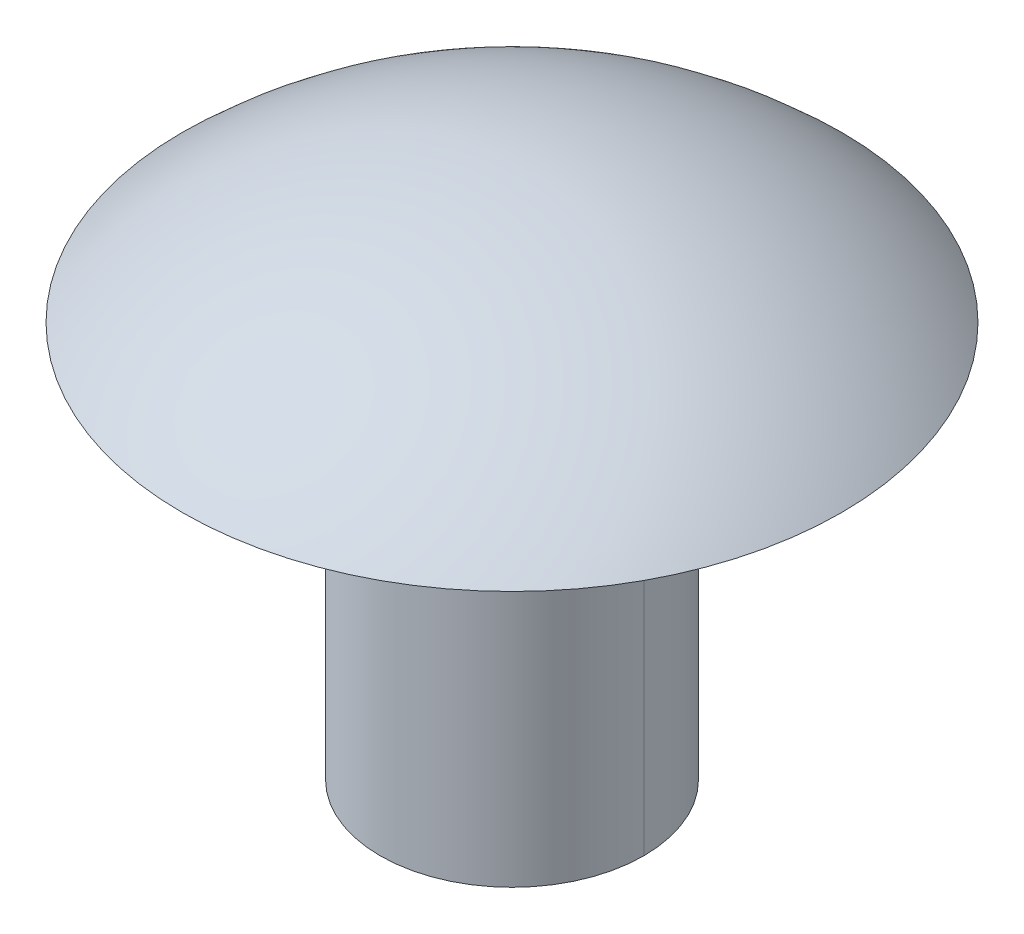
ISO-10303-21;
HEADER;
FILE_DESCRIPTION(('STEP AP214'),'2;1');
FILE_NAME('part.step','',(''),(''),'','','');
FILE_SCHEMA(('AUTOMOTIVE_DESIGN { 1 0 10303 214 1 1 1 1 }'));
ENDSEC;
DATA;
#1=APPLICATION_CONTEXT('core data for automotive mechanical design processes');
#2=APPLICATION_PROTOCOL_DEFINITION('international standard','automotive_design',2000,#1);
#3=PRODUCT_CONTEXT('',#1,'mechanical');
#4=PRODUCT('Part','Part','',(#3));
#5=PRODUCT_RELATED_PRODUCT_CATEGORY('part','',(#4));
#6=PRODUCT_DEFINITION_FORMATION('','',#4);
#7=PRODUCT_DEFINITION_CONTEXT('part definition',#1,'design');
#8=PRODUCT_DEFINITION('design','',#6,#7);
#9=PRODUCT_DEFINITION_SHAPE('','',#8);
#10=(LENGTH_UNIT() NAMED_UNIT(*) SI_UNIT(.MILLI.,.METRE.));
#11=(NAMED_UNIT(*) PLANE_ANGLE_UNIT() SI_UNIT($,.RADIAN.));
#12=(NAMED_UNIT(*) SI_UNIT($,.STERADIAN.) SOLID_ANGLE_UNIT());
#13=UNCERTAINTY_MEASURE_WITH_UNIT(LENGTH_MEASURE(1.E-05),#10,'distance_accuracy_value','');
#14=(GEOMETRIC_REPRESENTATION_CONTEXT(3) GLOBAL_UNCERTAINTY_ASSIGNED_CONTEXT((#13)) GLOBAL_UNIT_ASSIGNED_CONTEXT((#10,
#11,#12)) REPRESENTATION_CONTEXT('',''));
#15=CARTESIAN_POINT('',(0.,0.,0.));
#16=DIRECTION('',(0.,0.,1.));
#17=DIRECTION('',(1.,0.,0.));
#18=AXIS2_PLACEMENT_3D('',#15,#16,#17);
#19=CARTESIAN_POINT('',(0.,-14.3002,0.));
#20=DIRECTION('',(0.,1.,0.));
#21=DIRECTION('',(0.,0.,1.));
#22=AXIS2_PLACEMENT_3D('',#19,#20,#21);
#23=PLANE('',#22);
#24=DIRECTION('',(-1.,0.,0.));
#25=VECTOR('',#24,1.);
#26=CARTESIAN_POINT('',(0.,-14.3002,0.));
#27=LINE('',#26,#25);
#28=CARTESIAN_POINT('',(4.7625,-14.3002,0.));
#29=VERTEX_POINT('',#28);
#30=CARTESIAN_POINT('',(-4.7625,-14.3002,0.));
#31=VERTEX_POINT('',#30);
#32=EDGE_CURVE('E11',#29,#31,#27,.T.);
#33=ORIENTED_EDGE('',*,*,#32,.F.);
#34=CARTESIAN_POINT('',(0.,-14.3002,0.));
#35=DIRECTION('',(0.,1.,0.));
#36=DIRECTION('',(0.,0.,1.));
#37=AXIS2_PLACEMENT_3D('',#34,#35,#36);
#38=CIRCLE('',#37,4.7625);
#39=EDGE_CURVE('E75',#31,#29,#38,.T.);
#40=ORIENTED_EDGE('',*,*,#39,.F.);
#41=EDGE_LOOP('',(#33,#40));
#42=FACE_BOUND('',#41,.T.);
#43=ADVANCED_FACE('F38',(#42),#23,.F.);
#44=CARTESIAN_POINT('',(0.,0.,0.));
#45=DIRECTION('',(0.,1.,0.));
#46=DIRECTION('',(-1.,0.,0.));
#47=AXIS2_PLACEMENT_3D('',#44,#45,#46);
#48=PLANE('',#47);
#49=DIRECTION('',(-1.,0.,0.));
#50=VECTOR('',#49,1.);
#51=CARTESIAN_POINT('',(0.,0.,0.));
#52=LINE('',#51,#50);
#53=CARTESIAN_POINT('',(11.8999,0.,0.));
#54=VERTEX_POINT('',#53);
#55=CARTESIAN_POINT('',(4.7625,0.,0.));
#56=VERTEX_POINT('',#55);
#57=EDGE_CURVE('E48',#54,#56,#52,.T.);
#58=ORIENTED_EDGE('',*,*,#57,.F.);
#59=CARTESIAN_POINT('',(0.,0.,0.));
#60=DIRECTION('',(0.,1.,0.));
#61=DIRECTION('',(-1.,0.,0.));
#62=AXIS2_PLACEMENT_3D('',#59,#60,#61);
#63=CIRCLE('',#62,11.8999);
#64=CARTESIAN_POINT('',(-11.8999,0.,0.));
#65=VERTEX_POINT('',#64);
#66=EDGE_CURVE('E95',#65,#54,#63,.T.);
#67=ORIENTED_EDGE('',*,*,#66,.F.);
#68=CARTESIAN_POINT('',(-4.7625,0.,0.));
#69=VERTEX_POINT('',#68);
#70=EDGE_CURVE('E61',#69,#65,#52,.T.);
#71=ORIENTED_EDGE('',*,*,#70,.F.);
#72=CARTESIAN_POINT('',(0.,0.,0.));
#73=DIRECTION('',(0.,1.,0.));
#74=DIRECTION('',(0.,0.,1.));
#75=AXIS2_PLACEMENT_3D('',#72,#73,#74);
#76=CIRCLE('',#75,4.7625);
#77=EDGE_CURVE('E97',#69,#56,#76,.T.);
#78=ORIENTED_EDGE('',*,*,#77,.T.);
#79=EDGE_LOOP('',(#58,#67,#71,#78));
#80=FACE_BOUND('',#79,.T.);
#81=ADVANCED_FACE('F117',(#80),#48,.F.);
#82=CARTESIAN_POINT('',(0.,-14.3002,0.));
#83=DIRECTION('',(0.,1.,0.));
#84=DIRECTION('',(0.,0.,1.));
#85=AXIS2_PLACEMENT_3D('',#82,#83,#84);
#86=CYLINDRICAL_SURFACE('',#85,4.7625);
#87=ORIENTED_EDGE('',*,*,#77,.F.);
#88=DIRECTION('',(0.,1.,0.));
#89=VECTOR('',#88,1.);
#90=CARTESIAN_POINT('',(-4.7625,-14.3002,0.));
#91=LINE('',#90,#89);
#92=EDGE_CURVE('E89',#69,#31,#91,.F.);
#93=ORIENTED_EDGE('',*,*,#92,.T.);
#94=ORIENTED_EDGE('',*,*,#39,.T.);
#95=DIRECTION('',(0.,1.,0.));
#96=VECTOR('',#95,1.);
#97=CARTESIAN_POINT('',(4.7625,-14.3002,0.));
#98=LINE('',#97,#96);
#99=EDGE_CURVE('E42',#29,#56,#98,.T.);
#100=ORIENTED_EDGE('',*,*,#99,.T.);
#101=EDGE_LOOP('',(#87,#93,#94,#100));
#102=FACE_BOUND('',#101,.T.);
#103=ADVANCED_FACE('F90',(#102),#86,.T.);
#104=ORIENTED_EDGE('',*,*,#92,.F.);
#105=EDGE_CURVE('E85',#56,#69,#76,.T.);
#106=ORIENTED_EDGE('',*,*,#105,.F.);
#107=ORIENTED_EDGE('',*,*,#99,.F.);
#108=EDGE_CURVE('E84',#29,#31,#38,.T.);
#109=ORIENTED_EDGE('',*,*,#108,.T.);
#110=EDGE_LOOP('',(#104,#106,#107,#109));
#111=FACE_BOUND('',#110,.T.);
#112=ADVANCED_FACE('F40',(#111),#86,.T.);
#113=ORIENTED_EDGE('',*,*,#108,.F.);
#114=ORIENTED_EDGE('',*,*,#32,.T.);
#115=EDGE_LOOP('',(#113,#114));
#116=FACE_BOUND('',#115,.T.);
#117=ADVANCED_FACE('F92',(#116),#23,.F.);
#118=CARTESIAN_POINT('',(0.,-12.5317929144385,0.));
#119=DIRECTION('',(0.,1.,0.));
#120=DIRECTION('',(1.,0.,0.));
#121=AXIS2_PLACEMENT_3D('',#118,#119,#120);
#122=SPHERICAL_SURFACE('',#121,17.2815929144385);
#123=ORIENTED_EDGE('',*,*,#66,.T.);
#124=EDGE_CURVE('E113',#54,#65,#63,.T.);
#125=ORIENTED_EDGE('',*,*,#124,.T.);
#126=EDGE_LOOP('',(#123,#125));
#127=FACE_BOUND('',#126,.T.);
#128=ADVANCED_FACE('F116',(#127),#122,.T.);
#129=ORIENTED_EDGE('',*,*,#124,.F.);
#130=ORIENTED_EDGE('',*,*,#57,.T.);
#131=ORIENTED_EDGE('',*,*,#105,.T.);
#132=ORIENTED_EDGE('',*,*,#70,.T.);
#133=EDGE_LOOP('',(#129,#130,#131,#132));
#134=FACE_BOUND('',#133,.T.);
#135=ADVANCED_FACE('F112',(#134),#48,.F.);
#136=CLOSED_SHELL('',(#43,#81,#103,#112,#117,#128,#135));
#137=MANIFOLD_SOLID_BREP('B2',#136);
#138=ADVANCED_BREP_SHAPE_REPRESENTATION('',(#18,#137),#14);
#139=SHAPE_DEFINITION_REPRESENTATION(#9,#138);
ENDSEC;
END-ISO-10303-21;
